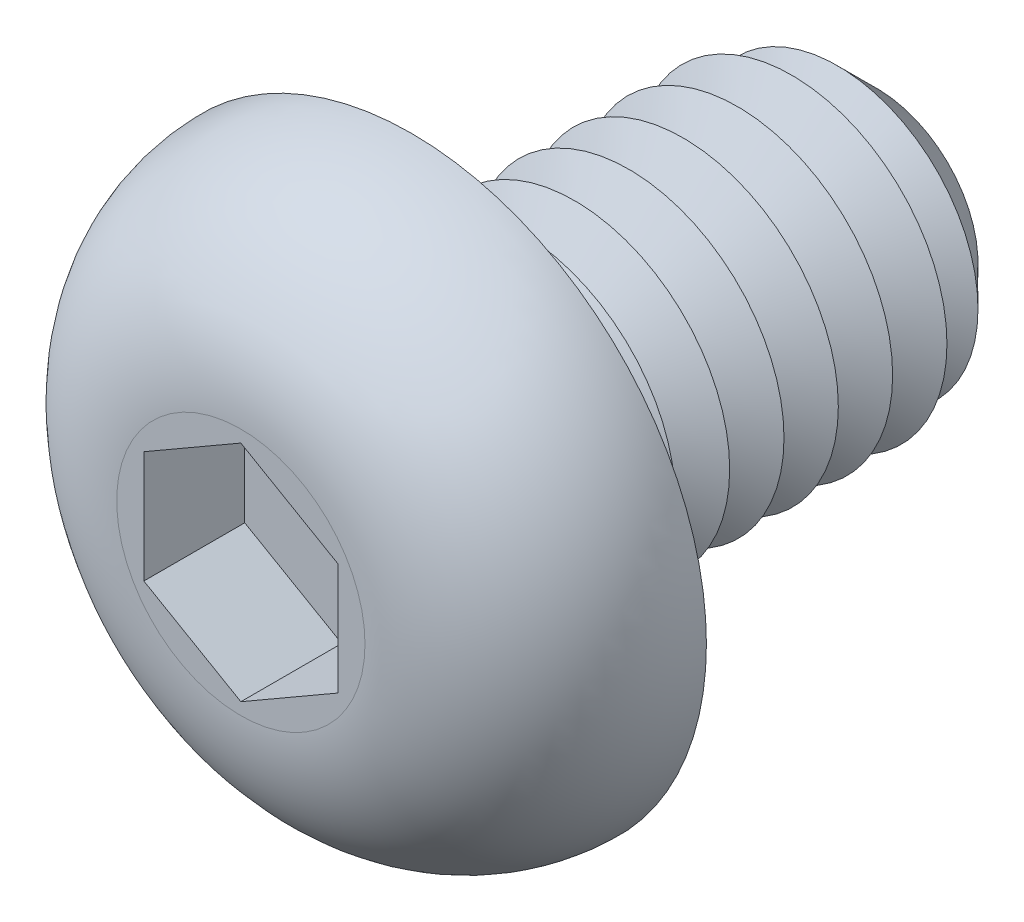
ISO-10303-21;
HEADER;
FILE_DESCRIPTION(('STEP AP214'),'2;1');
FILE_NAME('part.step','',(''),(''),'','','');
FILE_SCHEMA(('AUTOMOTIVE_DESIGN { 1 0 10303 214 1 1 1 1 }'));
ENDSEC;
DATA;
#1=APPLICATION_CONTEXT('core data for automotive mechanical design processes');
#2=APPLICATION_PROTOCOL_DEFINITION('international standard','automotive_design',2000,#1);
#3=PRODUCT_CONTEXT('',#1,'mechanical');
#4=PRODUCT('Part','Part','',(#3));
#5=PRODUCT_RELATED_PRODUCT_CATEGORY('part','',(#4));
#6=PRODUCT_DEFINITION_FORMATION('','',#4);
#7=PRODUCT_DEFINITION_CONTEXT('part definition',#1,'design');
#8=PRODUCT_DEFINITION('design','',#6,#7);
#9=PRODUCT_DEFINITION_SHAPE('','',#8);
#10=(LENGTH_UNIT() NAMED_UNIT(*) SI_UNIT(.MILLI.,.METRE.));
#11=(NAMED_UNIT(*) PLANE_ANGLE_UNIT() SI_UNIT($,.RADIAN.));
#12=(NAMED_UNIT(*) SI_UNIT($,.STERADIAN.) SOLID_ANGLE_UNIT());
#13=UNCERTAINTY_MEASURE_WITH_UNIT(LENGTH_MEASURE(1.E-05),#10,'distance_accuracy_value','');
#14=(GEOMETRIC_REPRESENTATION_CONTEXT(3) GLOBAL_UNCERTAINTY_ASSIGNED_CONTEXT((#13)) GLOBAL_UNIT_ASSIGNED_CONTEXT((#10,
#11,#12)) REPRESENTATION_CONTEXT('',''));
#15=CARTESIAN_POINT('',(0.,0.,0.));
#16=DIRECTION('',(0.,0.,1.));
#17=DIRECTION('',(1.,0.,0.));
#18=AXIS2_PLACEMENT_3D('',#15,#16,#17);
#19=CARTESIAN_POINT('',(0.,0.,-6.));
#20=DIRECTION('',(0.,0.,1.));
#21=DIRECTION('',(1.,0.,0.));
#22=AXIS2_PLACEMENT_3D('',#19,#20,#21);
#23=CYLINDRICAL_SURFACE('',#22,2.);
#24=CARTESIAN_POINT('',(0.,0.,-0.35));
#25=DIRECTION('',(0.,0.,1.));
#26=DIRECTION('',(1.,0.,0.));
#27=AXIS2_PLACEMENT_3D('',#24,#25,#26);
#28=CIRCLE('',#27,2.);
#29=CARTESIAN_POINT('',(2.,0.,-0.35));
#30=VERTEX_POINT('',#29);
#31=EDGE_CURVE('E48',#30,#30,#28,.F.);
#32=ORIENTED_EDGE('',*,*,#31,.T.);
#33=EDGE_LOOP('',(#32));
#34=FACE_BOUND('',#33,.T.);
#35=CARTESIAN_POINT('',(0.,0.,-0.699999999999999));
#36=DIRECTION('',(0.,0.,1.));
#37=DIRECTION('',(1.,0.,0.));
#38=AXIS2_PLACEMENT_3D('',#35,#36,#37);
#39=CIRCLE('',#38,2.);
#40=CARTESIAN_POINT('',(2.,0.,-0.699999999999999));
#41=VERTEX_POINT('',#40);
#42=EDGE_CURVE('E136',#41,#41,#39,.T.);
#43=ORIENTED_EDGE('',*,*,#42,.T.);
#44=EDGE_LOOP('',(#43));
#45=FACE_BOUND('',#44,.T.);
#46=ADVANCED_FACE('F39',(#34,#45),#23,.T.);
#47=CARTESIAN_POINT('',(0.,3.8,0.));
#48=DIRECTION('',(0.,0.,1.));
#49=DIRECTION('',(1.,0.,0.));
#50=AXIS2_PLACEMENT_3D('',#47,#48,#49);
#51=PLANE('',#50);
#52=CARTESIAN_POINT('',(0.,0.,0.));
#53=DIRECTION('',(0.,0.,1.));
#54=DIRECTION('',(1.,0.,0.));
#55=AXIS2_PLACEMENT_3D('',#52,#53,#54);
#56=CIRCLE('',#55,2.35);
#57=CARTESIAN_POINT('',(2.35,0.,0.));
#58=VERTEX_POINT('',#57);
#59=EDGE_CURVE('E11',#58,#58,#56,.T.);
#60=ORIENTED_EDGE('',*,*,#59,.T.);
#61=EDGE_LOOP('',(#60));
#62=FACE_BOUND('',#61,.T.);
#63=CARTESIAN_POINT('',(0.,0.,0.));
#64=DIRECTION('',(0.,0.,1.));
#65=DIRECTION('',(1.,0.,0.));
#66=AXIS2_PLACEMENT_3D('',#63,#64,#65);
#67=CIRCLE('',#66,3.8);
#68=CARTESIAN_POINT('',(3.8,0.,0.));
#69=VERTEX_POINT('',#68);
#70=EDGE_CURVE('E155',#69,#69,#67,.T.);
#71=ORIENTED_EDGE('',*,*,#70,.F.);
#72=EDGE_LOOP('',(#71));
#73=FACE_BOUND('',#72,.T.);
#74=ADVANCED_FACE('F202',(#62,#73),#51,.F.);
#75=CARTESIAN_POINT('',(0.,0.,2.2));
#76=DIRECTION('',(0.,0.,-1.));
#77=DIRECTION('',(-1.,0.,0.));
#78=AXIS2_PLACEMENT_3D('',#75,#76,#77);
#79=PLANE('',#78);
#80=DIRECTION('',(-0.866025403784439,-0.5,0.));
#81=VECTOR('',#80,1.);
#82=CARTESIAN_POINT('',(0.,1.44337567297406,2.2));
#83=LINE('',#82,#81);
#84=CARTESIAN_POINT('',(0.,1.44337567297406,2.2));
#85=VERTEX_POINT('',#84);
#86=CARTESIAN_POINT('',(-1.25,0.721687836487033,2.2));
#87=VERTEX_POINT('',#86);
#88=EDGE_CURVE('E135',#85,#87,#83,.T.);
#89=ORIENTED_EDGE('',*,*,#88,.F.);
#90=DIRECTION('',(-0.866025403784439,0.5,0.));
#91=VECTOR('',#90,1.);
#92=CARTESIAN_POINT('',(1.25,0.721687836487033,2.2));
#93=LINE('',#92,#91);
#94=CARTESIAN_POINT('',(1.25,0.721687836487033,2.2));
#95=VERTEX_POINT('',#94);
#96=EDGE_CURVE('E55',#95,#85,#93,.T.);
#97=ORIENTED_EDGE('',*,*,#96,.F.);
#98=DIRECTION('',(0.,1.,0.));
#99=VECTOR('',#98,1.);
#100=CARTESIAN_POINT('',(1.25,-0.721687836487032,2.2));
#101=LINE('',#100,#99);
#102=CARTESIAN_POINT('',(1.25,-0.721687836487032,2.2));
#103=VERTEX_POINT('',#102);
#104=EDGE_CURVE('E149',#103,#95,#101,.T.);
#105=ORIENTED_EDGE('',*,*,#104,.F.);
#106=DIRECTION('',(0.866025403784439,0.5,0.));
#107=VECTOR('',#106,1.);
#108=CARTESIAN_POINT('',(0.,-1.44337567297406,2.2));
#109=LINE('',#108,#107);
#110=CARTESIAN_POINT('',(0.,-1.44337567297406,2.2));
#111=VERTEX_POINT('',#110);
#112=EDGE_CURVE('E146',#111,#103,#109,.T.);
#113=ORIENTED_EDGE('',*,*,#112,.F.);
#114=DIRECTION('',(0.866025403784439,-0.5,0.));
#115=VECTOR('',#114,1.);
#116=CARTESIAN_POINT('',(-1.25,-0.721687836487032,2.2));
#117=LINE('',#116,#115);
#118=CARTESIAN_POINT('',(-1.25,-0.721687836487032,2.2));
#119=VERTEX_POINT('',#118);
#120=EDGE_CURVE('E103',#119,#111,#117,.T.);
#121=ORIENTED_EDGE('',*,*,#120,.F.);
#122=DIRECTION('',(0.,-1.,0.));
#123=VECTOR('',#122,1.);
#124=CARTESIAN_POINT('',(-1.25,0.721687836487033,2.2));
#125=LINE('',#124,#123);
#126=EDGE_CURVE('E140',#87,#119,#125,.T.);
#127=ORIENTED_EDGE('',*,*,#126,.F.);
#128=EDGE_LOOP('',(#89,#97,#105,#113,#121,#127));
#129=FACE_BOUND('',#128,.T.);
#130=CARTESIAN_POINT('',(0.,0.,2.2));
#131=DIRECTION('',(0.,0.,1.));
#132=DIRECTION('',(1.,0.,0.));
#133=AXIS2_PLACEMENT_3D('',#130,#131,#132);
#134=CIRCLE('',#133,1.6);
#135=CARTESIAN_POINT('',(1.6,0.,2.2));
#136=VERTEX_POINT('',#135);
#137=EDGE_CURVE('E168',#136,#136,#134,.T.);
#138=ORIENTED_EDGE('',*,*,#137,.T.);
#139=EDGE_LOOP('',(#138));
#140=FACE_BOUND('',#139,.T.);
#141=ADVANCED_FACE('F207',(#129,#140),#79,.F.);
#142=CARTESIAN_POINT('',(0.,0.,0.));
#143=DIRECTION('',(0.,0.,1.));
#144=DIRECTION('',(1.,0.,0.));
#145=AXIS2_PLACEMENT_3D('',#142,#143,#144);
#146=DEGENERATE_TOROIDAL_SURFACE('',#145,1.6,2.2,.T.);
#147=ORIENTED_EDGE('',*,*,#137,.F.);
#148=EDGE_LOOP('',(#147));
#149=FACE_BOUND('',#148,.T.);
#150=ORIENTED_EDGE('',*,*,#70,.T.);
#151=EDGE_LOOP('',(#150));
#152=FACE_BOUND('',#151,.T.);
#153=ADVANCED_FACE('F235',(#149,#152),#146,.T.);
#154=CARTESIAN_POINT('',(1.25,0.721687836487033,0.9));
#155=DIRECTION('',(0.5,0.866025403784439,0.));
#156=DIRECTION('',(-0.866025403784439,0.5,0.));
#157=AXIS2_PLACEMENT_3D('',#154,#155,#156);
#158=PLANE('',#157);
#159=ORIENTED_EDGE('',*,*,#96,.T.);
#160=DIRECTION('',(0.,0.,1.));
#161=VECTOR('',#160,1.);
#162=CARTESIAN_POINT('',(0.,1.44337567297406,0.9));
#163=LINE('',#162,#161);
#164=CARTESIAN_POINT('',(0.,1.44337567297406,0.9));
#165=VERTEX_POINT('',#164);
#166=EDGE_CURVE('E85',#165,#85,#163,.T.);
#167=ORIENTED_EDGE('',*,*,#166,.F.);
#168=DIRECTION('',(-0.866025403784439,0.5,0.));
#169=VECTOR('',#168,1.);
#170=CARTESIAN_POINT('',(1.25,0.721687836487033,0.9));
#171=LINE('',#170,#169);
#172=CARTESIAN_POINT('',(1.25,0.721687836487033,0.9));
#173=VERTEX_POINT('',#172);
#174=EDGE_CURVE('E152',#173,#165,#171,.T.);
#175=ORIENTED_EDGE('',*,*,#174,.F.);
#176=DIRECTION('',(0.,0.,1.));
#177=VECTOR('',#176,1.);
#178=CARTESIAN_POINT('',(1.25,0.721687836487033,0.9));
#179=LINE('',#178,#177);
#180=EDGE_CURVE('E63',#173,#95,#179,.T.);
#181=ORIENTED_EDGE('',*,*,#180,.T.);
#182=EDGE_LOOP('',(#159,#167,#175,#181));
#183=FACE_BOUND('',#182,.T.);
#184=ADVANCED_FACE('F221',(#183),#158,.F.);
#185=CARTESIAN_POINT('',(1.25,-0.721687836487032,0.9));
#186=DIRECTION('',(1.,0.,0.));
#187=DIRECTION('',(0.,1.,0.));
#188=AXIS2_PLACEMENT_3D('',#185,#186,#187);
#189=PLANE('',#188);
#190=ORIENTED_EDGE('',*,*,#104,.T.);
#191=ORIENTED_EDGE('',*,*,#180,.F.);
#192=DIRECTION('',(0.,1.,0.));
#193=VECTOR('',#192,1.);
#194=CARTESIAN_POINT('',(1.25,-0.721687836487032,0.9));
#195=LINE('',#194,#193);
#196=CARTESIAN_POINT('',(1.25,-0.721687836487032,0.9));
#197=VERTEX_POINT('',#196);
#198=EDGE_CURVE('E117',#197,#173,#195,.T.);
#199=ORIENTED_EDGE('',*,*,#198,.F.);
#200=DIRECTION('',(0.,0.,1.));
#201=VECTOR('',#200,1.);
#202=CARTESIAN_POINT('',(1.25,-0.721687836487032,0.9));
#203=LINE('',#202,#201);
#204=EDGE_CURVE('E108',#197,#103,#203,.T.);
#205=ORIENTED_EDGE('',*,*,#204,.T.);
#206=EDGE_LOOP('',(#190,#191,#199,#205));
#207=FACE_BOUND('',#206,.T.);
#208=ADVANCED_FACE('F218',(#207),#189,.F.);
#209=CARTESIAN_POINT('',(0.,-1.44337567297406,0.9));
#210=DIRECTION('',(0.5,-0.866025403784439,0.));
#211=DIRECTION('',(0.866025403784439,0.5,0.));
#212=AXIS2_PLACEMENT_3D('',#209,#210,#211);
#213=PLANE('',#212);
#214=ORIENTED_EDGE('',*,*,#112,.T.);
#215=ORIENTED_EDGE('',*,*,#204,.F.);
#216=DIRECTION('',(0.866025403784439,0.5,0.));
#217=VECTOR('',#216,1.);
#218=CARTESIAN_POINT('',(0.,-1.44337567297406,0.9));
#219=LINE('',#218,#217);
#220=CARTESIAN_POINT('',(0.,-1.44337567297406,0.9));
#221=VERTEX_POINT('',#220);
#222=EDGE_CURVE('E112',#221,#197,#219,.T.);
#223=ORIENTED_EDGE('',*,*,#222,.F.);
#224=DIRECTION('',(0.,0.,1.));
#225=VECTOR('',#224,1.);
#226=CARTESIAN_POINT('',(0.,-1.44337567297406,0.9));
#227=LINE('',#226,#225);
#228=EDGE_CURVE('E96',#221,#111,#227,.T.);
#229=ORIENTED_EDGE('',*,*,#228,.T.);
#230=EDGE_LOOP('',(#214,#215,#223,#229));
#231=FACE_BOUND('',#230,.T.);
#232=ADVANCED_FACE('F113',(#231),#213,.F.);
#233=CARTESIAN_POINT('',(-1.25,-0.721687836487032,0.9));
#234=DIRECTION('',(-0.5,-0.866025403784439,0.));
#235=DIRECTION('',(0.866025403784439,-0.5,0.));
#236=AXIS2_PLACEMENT_3D('',#233,#234,#235);
#237=PLANE('',#236);
#238=ORIENTED_EDGE('',*,*,#120,.T.);
#239=ORIENTED_EDGE('',*,*,#228,.F.);
#240=DIRECTION('',(0.866025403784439,-0.5,0.));
#241=VECTOR('',#240,1.);
#242=CARTESIAN_POINT('',(-1.25,-0.721687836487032,0.9));
#243=LINE('',#242,#241);
#244=CARTESIAN_POINT('',(-1.25,-0.721687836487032,0.9));
#245=VERTEX_POINT('',#244);
#246=EDGE_CURVE('E100',#245,#221,#243,.T.);
#247=ORIENTED_EDGE('',*,*,#246,.F.);
#248=DIRECTION('',(0.,0.,1.));
#249=VECTOR('',#248,1.);
#250=CARTESIAN_POINT('',(-1.25,-0.721687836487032,0.9));
#251=LINE('',#250,#249);
#252=EDGE_CURVE('E109',#245,#119,#251,.T.);
#253=ORIENTED_EDGE('',*,*,#252,.T.);
#254=EDGE_LOOP('',(#238,#239,#247,#253));
#255=FACE_BOUND('',#254,.T.);
#256=ADVANCED_FACE('F98',(#255),#237,.F.);
#257=CARTESIAN_POINT('',(-1.25,0.721687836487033,0.9));
#258=DIRECTION('',(-1.,0.,0.));
#259=DIRECTION('',(0.,-1.,0.));
#260=AXIS2_PLACEMENT_3D('',#257,#258,#259);
#261=PLANE('',#260);
#262=ORIENTED_EDGE('',*,*,#126,.T.);
#263=ORIENTED_EDGE('',*,*,#252,.F.);
#264=DIRECTION('',(0.,-1.,0.));
#265=VECTOR('',#264,1.);
#266=CARTESIAN_POINT('',(-1.25,0.721687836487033,0.9));
#267=LINE('',#266,#265);
#268=CARTESIAN_POINT('',(-1.25,0.721687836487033,0.9));
#269=VERTEX_POINT('',#268);
#270=EDGE_CURVE('E123',#269,#245,#267,.T.);
#271=ORIENTED_EDGE('',*,*,#270,.F.);
#272=DIRECTION('',(0.,0.,1.));
#273=VECTOR('',#272,1.);
#274=CARTESIAN_POINT('',(-1.25,0.721687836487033,0.9));
#275=LINE('',#274,#273);
#276=EDGE_CURVE('E160',#269,#87,#275,.T.);
#277=ORIENTED_EDGE('',*,*,#276,.T.);
#278=EDGE_LOOP('',(#262,#263,#271,#277));
#279=FACE_BOUND('',#278,.T.);
#280=ADVANCED_FACE('F226',(#279),#261,.F.);
#281=CARTESIAN_POINT('',(0.,1.44337567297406,0.9));
#282=DIRECTION('',(-0.5,0.866025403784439,0.));
#283=DIRECTION('',(-0.866025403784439,-0.5,0.));
#284=AXIS2_PLACEMENT_3D('',#281,#282,#283);
#285=PLANE('',#284);
#286=ORIENTED_EDGE('',*,*,#88,.T.);
#287=ORIENTED_EDGE('',*,*,#276,.F.);
#288=DIRECTION('',(-0.866025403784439,-0.5,0.));
#289=VECTOR('',#288,1.);
#290=CARTESIAN_POINT('',(0.,1.44337567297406,0.9));
#291=LINE('',#290,#289);
#292=EDGE_CURVE('E127',#165,#269,#291,.T.);
#293=ORIENTED_EDGE('',*,*,#292,.F.);
#294=ORIENTED_EDGE('',*,*,#166,.T.);
#295=EDGE_LOOP('',(#286,#287,#293,#294));
#296=FACE_BOUND('',#295,.T.);
#297=ADVANCED_FACE('F216',(#296),#285,.F.);
#298=CARTESIAN_POINT('',(0.,0.,0.9));
#299=DIRECTION('',(0.,0.,1.));
#300=DIRECTION('',(1.,0.,0.));
#301=AXIS2_PLACEMENT_3D('',#298,#299,#300);
#302=PLANE('',#301);
#303=CARTESIAN_POINT('',(0.,0.,0.9));
#304=DIRECTION('',(0.,0.,1.));
#305=DIRECTION('',(1.,0.,0.));
#306=AXIS2_PLACEMENT_3D('',#303,#304,#305);
#307=CIRCLE('',#306,0.5);
#308=CARTESIAN_POINT('',(0.5,0.,0.9));
#309=VERTEX_POINT('',#308);
#310=EDGE_CURVE('E311',#309,#309,#307,.T.);
#311=ORIENTED_EDGE('',*,*,#310,.F.);
#312=EDGE_LOOP('',(#311));
#313=FACE_BOUND('',#312,.T.);
#314=ORIENTED_EDGE('',*,*,#174,.T.);
#315=ORIENTED_EDGE('',*,*,#292,.T.);
#316=ORIENTED_EDGE('',*,*,#270,.T.);
#317=ORIENTED_EDGE('',*,*,#246,.T.);
#318=ORIENTED_EDGE('',*,*,#222,.T.);
#319=ORIENTED_EDGE('',*,*,#198,.T.);
#320=EDGE_LOOP('',(#314,#315,#316,#317,#318,#319));
#321=FACE_BOUND('',#320,.T.);
#322=ADVANCED_FACE('F120',(#313,#321),#302,.T.);
#323=CARTESIAN_POINT('',(0.,0.,-0.699999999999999));
#324=DIRECTION('',(0.,0.,1.));
#325=DIRECTION('',(1.,0.,0.));
#326=AXIS2_PLACEMENT_3D('',#323,#324,#325);
#327=CONICAL_SURFACE('',#326,2.,1.04719755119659);
#328=CARTESIAN_POINT('',(0.,0.,-1.05));
#329=DIRECTION('',(0.,0.,1.));
#330=DIRECTION('',(1.,0.,0.));
#331=AXIS2_PLACEMENT_3D('',#328,#329,#330);
#332=CIRCLE('',#331,1.39378221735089);
#333=CARTESIAN_POINT('',(1.39378221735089,0.,-1.05));
#334=VERTEX_POINT('',#333);
#335=EDGE_CURVE('E258',#334,#334,#332,.T.);
#336=ORIENTED_EDGE('',*,*,#335,.T.);
#337=EDGE_LOOP('',(#336));
#338=FACE_BOUND('',#337,.T.);
#339=ORIENTED_EDGE('',*,*,#42,.F.);
#340=EDGE_LOOP('',(#339));
#341=FACE_BOUND('',#340,.T.);
#342=ADVANCED_FACE('F215',(#338,#341),#327,.T.);
#343=CARTESIAN_POINT('',(0.,0.,-1.05));
#344=DIRECTION('',(0.,0.,-1.));
#345=DIRECTION('',(-1.,0.,0.));
#346=AXIS2_PLACEMENT_3D('',#343,#344,#345);
#347=CONICAL_SURFACE('',#346,1.39378221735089,1.0471975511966);
#348=CARTESIAN_POINT('',(0.,0.,-1.4));
#349=DIRECTION('',(0.,0.,1.));
#350=DIRECTION('',(1.,0.,0.));
#351=AXIS2_PLACEMENT_3D('',#348,#349,#350);
#352=CIRCLE('',#351,2.);
#353=CARTESIAN_POINT('',(2.,0.,-1.4));
#354=VERTEX_POINT('',#353);
#355=EDGE_CURVE('E262',#354,#354,#352,.T.);
#356=ORIENTED_EDGE('',*,*,#355,.T.);
#357=EDGE_LOOP('',(#356));
#358=FACE_BOUND('',#357,.T.);
#359=ORIENTED_EDGE('',*,*,#335,.F.);
#360=EDGE_LOOP('',(#359));
#361=FACE_BOUND('',#360,.T.);
#362=ADVANCED_FACE('F393',(#358,#361),#347,.T.);
#363=CARTESIAN_POINT('',(0.,0.,-1.4));
#364=DIRECTION('',(0.,0.,1.));
#365=DIRECTION('',(1.,0.,0.));
#366=AXIS2_PLACEMENT_3D('',#363,#364,#365);
#367=CONICAL_SURFACE('',#366,2.,1.04719755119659);
#368=CARTESIAN_POINT('',(0.,0.,-1.75));
#369=DIRECTION('',(0.,0.,1.));
#370=DIRECTION('',(1.,0.,0.));
#371=AXIS2_PLACEMENT_3D('',#368,#369,#370);
#372=CIRCLE('',#371,1.39378221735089);
#373=CARTESIAN_POINT('',(1.39378221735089,0.,-1.75));
#374=VERTEX_POINT('',#373);
#375=EDGE_CURVE('E265',#374,#374,#372,.T.);
#376=ORIENTED_EDGE('',*,*,#375,.T.);
#377=EDGE_LOOP('',(#376));
#378=FACE_BOUND('',#377,.T.);
#379=ORIENTED_EDGE('',*,*,#355,.F.);
#380=EDGE_LOOP('',(#379));
#381=FACE_BOUND('',#380,.T.);
#382=ADVANCED_FACE('F387',(#378,#381),#367,.T.);
#383=CARTESIAN_POINT('',(0.,0.,-1.75));
#384=DIRECTION('',(0.,0.,-1.));
#385=DIRECTION('',(-1.,0.,0.));
#386=AXIS2_PLACEMENT_3D('',#383,#384,#385);
#387=CONICAL_SURFACE('',#386,1.39378221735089,1.0471975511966);
#388=CARTESIAN_POINT('',(0.,0.,-2.1));
#389=DIRECTION('',(0.,0.,1.));
#390=DIRECTION('',(1.,0.,0.));
#391=AXIS2_PLACEMENT_3D('',#388,#389,#390);
#392=CIRCLE('',#391,2.);
#393=CARTESIAN_POINT('',(2.,0.,-2.1));
#394=VERTEX_POINT('',#393);
#395=EDGE_CURVE('E269',#394,#394,#392,.T.);
#396=ORIENTED_EDGE('',*,*,#395,.T.);
#397=EDGE_LOOP('',(#396));
#398=FACE_BOUND('',#397,.T.);
#399=ORIENTED_EDGE('',*,*,#375,.F.);
#400=EDGE_LOOP('',(#399));
#401=FACE_BOUND('',#400,.T.);
#402=ADVANCED_FACE('F381',(#398,#401),#387,.T.);
#403=CARTESIAN_POINT('',(0.,0.,-2.1));
#404=DIRECTION('',(0.,0.,1.));
#405=DIRECTION('',(1.,0.,0.));
#406=AXIS2_PLACEMENT_3D('',#403,#404,#405);
#407=CONICAL_SURFACE('',#406,2.,1.04719755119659);
#408=CARTESIAN_POINT('',(0.,0.,-2.45));
#409=DIRECTION('',(0.,0.,1.));
#410=DIRECTION('',(1.,0.,0.));
#411=AXIS2_PLACEMENT_3D('',#408,#409,#410);
#412=CIRCLE('',#411,1.39378221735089);
#413=CARTESIAN_POINT('',(1.39378221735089,0.,-2.45));
#414=VERTEX_POINT('',#413);
#415=EDGE_CURVE('E273',#414,#414,#412,.T.);
#416=ORIENTED_EDGE('',*,*,#415,.T.);
#417=EDGE_LOOP('',(#416));
#418=FACE_BOUND('',#417,.T.);
#419=ORIENTED_EDGE('',*,*,#395,.F.);
#420=EDGE_LOOP('',(#419));
#421=FACE_BOUND('',#420,.T.);
#422=ADVANCED_FACE('F375',(#418,#421),#407,.T.);
#423=CARTESIAN_POINT('',(0.,0.,-2.45));
#424=DIRECTION('',(0.,0.,-1.));
#425=DIRECTION('',(-1.,0.,0.));
#426=AXIS2_PLACEMENT_3D('',#423,#424,#425);
#427=CONICAL_SURFACE('',#426,1.39378221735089,1.0471975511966);
#428=CARTESIAN_POINT('',(0.,0.,-2.8));
#429=DIRECTION('',(0.,0.,1.));
#430=DIRECTION('',(1.,0.,0.));
#431=AXIS2_PLACEMENT_3D('',#428,#429,#430);
#432=CIRCLE('',#431,2.);
#433=CARTESIAN_POINT('',(2.,0.,-2.8));
#434=VERTEX_POINT('',#433);
#435=EDGE_CURVE('E277',#434,#434,#432,.T.);
#436=ORIENTED_EDGE('',*,*,#435,.T.);
#437=EDGE_LOOP('',(#436));
#438=FACE_BOUND('',#437,.T.);
#439=ORIENTED_EDGE('',*,*,#415,.F.);
#440=EDGE_LOOP('',(#439));
#441=FACE_BOUND('',#440,.T.);
#442=ADVANCED_FACE('F369',(#438,#441),#427,.T.);
#443=CARTESIAN_POINT('',(0.,0.,-2.8));
#444=DIRECTION('',(0.,0.,1.));
#445=DIRECTION('',(1.,0.,0.));
#446=AXIS2_PLACEMENT_3D('',#443,#444,#445);
#447=CONICAL_SURFACE('',#446,2.,1.04719755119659);
#448=CARTESIAN_POINT('',(0.,0.,-3.15));
#449=DIRECTION('',(0.,0.,1.));
#450=DIRECTION('',(1.,0.,0.));
#451=AXIS2_PLACEMENT_3D('',#448,#449,#450);
#452=CIRCLE('',#451,1.39378221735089);
#453=CARTESIAN_POINT('',(1.39378221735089,0.,-3.15));
#454=VERTEX_POINT('',#453);
#455=EDGE_CURVE('E281',#454,#454,#452,.T.);
#456=ORIENTED_EDGE('',*,*,#455,.T.);
#457=EDGE_LOOP('',(#456));
#458=FACE_BOUND('',#457,.T.);
#459=ORIENTED_EDGE('',*,*,#435,.F.);
#460=EDGE_LOOP('',(#459));
#461=FACE_BOUND('',#460,.T.);
#462=ADVANCED_FACE('F363',(#458,#461),#447,.T.);
#463=CARTESIAN_POINT('',(0.,0.,-3.15));
#464=DIRECTION('',(0.,0.,-1.));
#465=DIRECTION('',(-1.,0.,0.));
#466=AXIS2_PLACEMENT_3D('',#463,#464,#465);
#467=CONICAL_SURFACE('',#466,1.39378221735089,1.0471975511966);
#468=CARTESIAN_POINT('',(0.,0.,-3.5));
#469=DIRECTION('',(0.,0.,1.));
#470=DIRECTION('',(1.,0.,0.));
#471=AXIS2_PLACEMENT_3D('',#468,#469,#470);
#472=CIRCLE('',#471,2.);
#473=CARTESIAN_POINT('',(2.,0.,-3.5));
#474=VERTEX_POINT('',#473);
#475=EDGE_CURVE('E285',#474,#474,#472,.T.);
#476=ORIENTED_EDGE('',*,*,#475,.T.);
#477=EDGE_LOOP('',(#476));
#478=FACE_BOUND('',#477,.T.);
#479=ORIENTED_EDGE('',*,*,#455,.F.);
#480=EDGE_LOOP('',(#479));
#481=FACE_BOUND('',#480,.T.);
#482=ADVANCED_FACE('F357',(#478,#481),#467,.T.);
#483=CARTESIAN_POINT('',(0.,0.,-3.5));
#484=DIRECTION('',(0.,0.,1.));
#485=DIRECTION('',(1.,0.,0.));
#486=AXIS2_PLACEMENT_3D('',#483,#484,#485);
#487=CONICAL_SURFACE('',#486,2.,1.04719755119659);
#488=CARTESIAN_POINT('',(0.,0.,-3.85));
#489=DIRECTION('',(0.,0.,1.));
#490=DIRECTION('',(1.,0.,0.));
#491=AXIS2_PLACEMENT_3D('',#488,#489,#490);
#492=CIRCLE('',#491,1.39378221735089);
#493=CARTESIAN_POINT('',(1.39378221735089,0.,-3.85));
#494=VERTEX_POINT('',#493);
#495=EDGE_CURVE('E289',#494,#494,#492,.T.);
#496=ORIENTED_EDGE('',*,*,#495,.T.);
#497=EDGE_LOOP('',(#496));
#498=FACE_BOUND('',#497,.T.);
#499=ORIENTED_EDGE('',*,*,#475,.F.);
#500=EDGE_LOOP('',(#499));
#501=FACE_BOUND('',#500,.T.);
#502=ADVANCED_FACE('F351',(#498,#501),#487,.T.);
#503=CARTESIAN_POINT('',(0.,0.,-3.85));
#504=DIRECTION('',(0.,0.,-1.));
#505=DIRECTION('',(-1.,0.,0.));
#506=AXIS2_PLACEMENT_3D('',#503,#504,#505);
#507=CONICAL_SURFACE('',#506,1.39378221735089,1.0471975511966);
#508=CARTESIAN_POINT('',(0.,0.,-4.2));
#509=DIRECTION('',(0.,0.,1.));
#510=DIRECTION('',(1.,0.,0.));
#511=AXIS2_PLACEMENT_3D('',#508,#509,#510);
#512=CIRCLE('',#511,2.);
#513=CARTESIAN_POINT('',(2.,0.,-4.2));
#514=VERTEX_POINT('',#513);
#515=EDGE_CURVE('E293',#514,#514,#512,.T.);
#516=ORIENTED_EDGE('',*,*,#515,.T.);
#517=EDGE_LOOP('',(#516));
#518=FACE_BOUND('',#517,.T.);
#519=ORIENTED_EDGE('',*,*,#495,.F.);
#520=EDGE_LOOP('',(#519));
#521=FACE_BOUND('',#520,.T.);
#522=ADVANCED_FACE('F345',(#518,#521),#507,.T.);
#523=CARTESIAN_POINT('',(0.,0.,-4.2));
#524=DIRECTION('',(0.,0.,1.));
#525=DIRECTION('',(1.,0.,0.));
#526=AXIS2_PLACEMENT_3D('',#523,#524,#525);
#527=CONICAL_SURFACE('',#526,2.,1.04719755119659);
#528=CARTESIAN_POINT('',(0.,0.,-4.55));
#529=DIRECTION('',(0.,0.,1.));
#530=DIRECTION('',(1.,0.,0.));
#531=AXIS2_PLACEMENT_3D('',#528,#529,#530);
#532=CIRCLE('',#531,1.39378221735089);
#533=CARTESIAN_POINT('',(1.39378221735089,0.,-4.55));
#534=VERTEX_POINT('',#533);
#535=EDGE_CURVE('E179',#534,#534,#532,.T.);
#536=ORIENTED_EDGE('',*,*,#535,.T.);
#537=EDGE_LOOP('',(#536));
#538=FACE_BOUND('',#537,.T.);
#539=ORIENTED_EDGE('',*,*,#515,.F.);
#540=EDGE_LOOP('',(#539));
#541=FACE_BOUND('',#540,.T.);
#542=ADVANCED_FACE('F339',(#538,#541),#527,.T.);
#543=CARTESIAN_POINT('',(0.,0.,-4.55));
#544=DIRECTION('',(0.,0.,-1.));
#545=DIRECTION('',(-1.,0.,0.));
#546=AXIS2_PLACEMENT_3D('',#543,#544,#545);
#547=CONICAL_SURFACE('',#546,1.39378221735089,1.0471975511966);
#548=CARTESIAN_POINT('',(0.,0.,-4.9));
#549=DIRECTION('',(0.,0.,1.));
#550=DIRECTION('',(1.,0.,0.));
#551=AXIS2_PLACEMENT_3D('',#548,#549,#550);
#552=CIRCLE('',#551,2.);
#553=CARTESIAN_POINT('',(2.,0.,-4.9));
#554=VERTEX_POINT('',#553);
#555=EDGE_CURVE('E180',#554,#554,#552,.T.);
#556=ORIENTED_EDGE('',*,*,#555,.T.);
#557=EDGE_LOOP('',(#556));
#558=FACE_BOUND('',#557,.T.);
#559=ORIENTED_EDGE('',*,*,#535,.F.);
#560=EDGE_LOOP('',(#559));
#561=FACE_BOUND('',#560,.T.);
#562=ADVANCED_FACE('F333',(#558,#561),#547,.T.);
#563=CARTESIAN_POINT('',(0.,0.,-4.9));
#564=DIRECTION('',(0.,0.,1.));
#565=DIRECTION('',(1.,0.,0.));
#566=AXIS2_PLACEMENT_3D('',#563,#564,#565);
#567=CONICAL_SURFACE('',#566,2.,1.04719755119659);
#568=CARTESIAN_POINT('',(0.,0.,-5.25));
#569=DIRECTION('',(0.,0.,1.));
#570=DIRECTION('',(1.,0.,0.));
#571=AXIS2_PLACEMENT_3D('',#568,#569,#570);
#572=CIRCLE('',#571,1.39378221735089);
#573=CARTESIAN_POINT('',(1.39378221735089,0.,-5.25));
#574=VERTEX_POINT('',#573);
#575=EDGE_CURVE('E303',#574,#574,#572,.T.);
#576=ORIENTED_EDGE('',*,*,#575,.T.);
#577=EDGE_LOOP('',(#576));
#578=FACE_BOUND('',#577,.T.);
#579=ORIENTED_EDGE('',*,*,#555,.F.);
#580=EDGE_LOOP('',(#579));
#581=FACE_BOUND('',#580,.T.);
#582=ADVANCED_FACE('F327',(#578,#581),#567,.T.);
#583=CARTESIAN_POINT('',(0.,0.,-5.25));
#584=DIRECTION('',(0.,0.,-1.));
#585=DIRECTION('',(-1.,0.,0.));
#586=AXIS2_PLACEMENT_3D('',#583,#584,#585);
#587=CONICAL_SURFACE('',#586,1.39378221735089,1.0471975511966);
#588=CARTESIAN_POINT('',(0.,0.,-5.49019237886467));
#589=DIRECTION('',(0.,0.,-1.));
#590=DIRECTION('',(-1.,0.,0.));
#591=AXIS2_PLACEMENT_3D('',#588,#589,#590);
#592=CIRCLE('',#591,1.80980762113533);
#593=CARTESIAN_POINT('',(-1.80980762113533,0.,-5.49019237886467));
#594=VERTEX_POINT('',#593);
#595=EDGE_CURVE('E176',#594,#594,#592,.T.);
#596=ORIENTED_EDGE('',*,*,#595,.F.);
#597=EDGE_LOOP('',(#596));
#598=FACE_BOUND('',#597,.T.);
#599=ORIENTED_EDGE('',*,*,#575,.F.);
#600=EDGE_LOOP('',(#599));
#601=FACE_BOUND('',#600,.T.);
#602=ADVANCED_FACE('F320',(#598,#601),#587,.T.);
#603=CARTESIAN_POINT('',(0.,0.,-6.));
#604=DIRECTION('',(0.,0.,-1.));
#605=DIRECTION('',(-1.,0.,0.));
#606=AXIS2_PLACEMENT_3D('',#603,#604,#605);
#607=PLANE('',#606);
#608=CARTESIAN_POINT('',(0.,0.,-6.));
#609=DIRECTION('',(0.,0.,-1.));
#610=DIRECTION('',(-1.,0.,0.));
#611=AXIS2_PLACEMENT_3D('',#608,#609,#610);
#612=CIRCLE('',#611,0.5);
#613=CARTESIAN_POINT('',(-0.5,0.,-6.));
#614=VERTEX_POINT('',#613);
#615=EDGE_CURVE('E307',#614,#614,#612,.F.);
#616=ORIENTED_EDGE('',*,*,#615,.T.);
#617=EDGE_LOOP('',(#616));
#618=FACE_BOUND('',#617,.T.);
#619=CARTESIAN_POINT('',(0.,0.,-6.));
#620=DIRECTION('',(0.,0.,-1.));
#621=DIRECTION('',(-1.,0.,0.));
#622=AXIS2_PLACEMENT_3D('',#619,#620,#621);
#623=CIRCLE('',#622,1.3);
#624=CARTESIAN_POINT('',(-1.3,0.,-6.));
#625=VERTEX_POINT('',#624);
#626=EDGE_CURVE('E172',#625,#625,#623,.T.);
#627=ORIENTED_EDGE('',*,*,#626,.T.);
#628=EDGE_LOOP('',(#627));
#629=FACE_BOUND('',#628,.T.);
#630=ADVANCED_FACE('F198',(#618,#629),#607,.T.);
#631=CARTESIAN_POINT('',(0.,0.,-6.));
#632=DIRECTION('',(0.,0.,1.));
#633=DIRECTION('',(1.,0.,0.));
#634=AXIS2_PLACEMENT_3D('',#631,#632,#633);
#635=CONICAL_SURFACE('',#634,1.3,0.785398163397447);
#636=ORIENTED_EDGE('',*,*,#626,.F.);
#637=EDGE_LOOP('',(#636));
#638=FACE_BOUND('',#637,.T.);
#639=ORIENTED_EDGE('',*,*,#595,.T.);
#640=EDGE_LOOP('',(#639));
#641=FACE_BOUND('',#640,.T.);
#642=ADVANCED_FACE('F190',(#638,#641),#635,.T.);
#643=CARTESIAN_POINT('',(0.,0.,-0.35));
#644=DIRECTION('',(0.,0.,1.));
#645=DIRECTION('',(1.,0.,0.));
#646=AXIS2_PLACEMENT_3D('',#643,#644,#645);
#647=TOROIDAL_SURFACE('',#646,2.35,0.35);
#648=ORIENTED_EDGE('',*,*,#59,.F.);
#649=EDGE_LOOP('',(#648));
#650=FACE_BOUND('',#649,.T.);
#651=ORIENTED_EDGE('',*,*,#31,.F.);
#652=EDGE_LOOP('',(#651));
#653=FACE_BOUND('',#652,.T.);
#654=ADVANCED_FACE('F41',(#650,#653),#647,.F.);
#655=CARTESIAN_POINT('',(0.,0.,-7.4142135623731));
#656=DIRECTION('',(0.,0.,1.));
#657=DIRECTION('',(1.,0.,0.));
#658=AXIS2_PLACEMENT_3D('',#655,#656,#657);
#659=CYLINDRICAL_SURFACE('',#658,0.5);
#660=ORIENTED_EDGE('',*,*,#310,.T.);
#661=EDGE_LOOP('',(#660));
#662=FACE_BOUND('',#661,.T.);
#663=ORIENTED_EDGE('',*,*,#615,.F.);
#664=EDGE_LOOP('',(#663));
#665=FACE_BOUND('',#664,.T.);
#666=ADVANCED_FACE('F189',(#662,#665),#659,.F.);
#667=CLOSED_SHELL('',(#46,#74,#141,#153,#184,#208,#232,#256,#280,#297,#322,#342,#362,#382,#402,
#422,#442,#462,#482,#502,#522,#542,#562,#582,#602,#630,#642,#654,#666));
#668=MANIFOLD_SOLID_BREP('B2',#667);
#669=ADVANCED_BREP_SHAPE_REPRESENTATION('',(#18,#668),#14);
#670=SHAPE_DEFINITION_REPRESENTATION(#9,#669);
ENDSEC;
END-ISO-10303-21;
